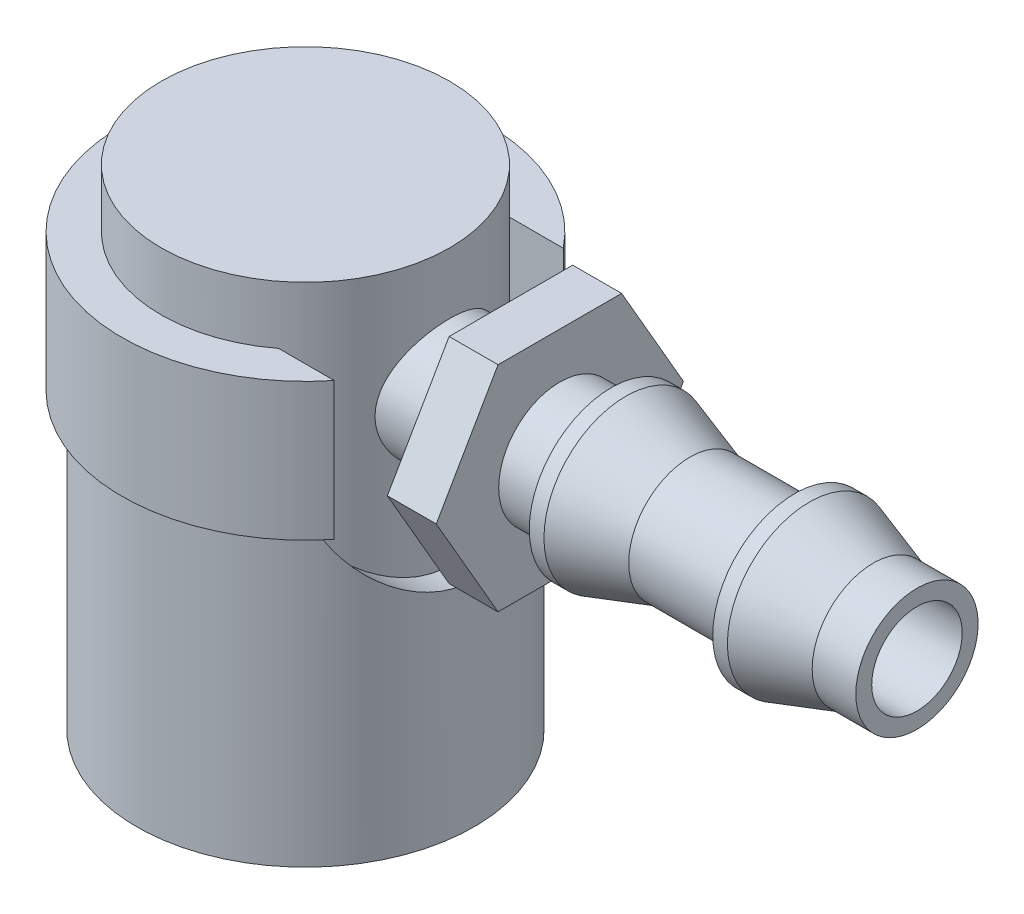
from build123d import *

# Parameters (mm, degrees)
BOSS_EXTRUDE1_DEPTH = 2.54
CUT_EXTRUDE1_REACH  = 44.99
SKETCH5_R           = 2.3495
SKETCH7_R           = 8.763
SKETCH7_R_2         = 7.493
BOSS_EXTRUDE2_DEPTH = 15.24
SKETCH9_R           = 6.35
CUT_EXTRUDE3_DEPTH  = 37.563209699
BOSS_EXTRUDE3_DEPTH = 7.14375
SKETCH10_W          = 1.4859
SKETCH10_H          = 4.445


with BuildPart() as part:
    # Sketch2 → Revolve1 (revolve)
    with BuildSketch(Plane.XY, mode=Mode.PRIVATE) as revolve1_sk:
        Polygon((0, 15.875), (7.493, 15.875), (7.493, -9.525), (4.7625, -9.525), (4.7625, -1.397), (5.0546, -1.228355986), (5.0546, 3.175), (3.5687, 3.175), (3.5687, 13.1445), (0, 13.1445), align=None)
    revolve(revolve1_sk.sketch.rotate(Axis((0, 0, 0), (0, 1, 0)), 90), axis=Axis((0, 0, 0), (0, 1, 0)))

    # Sketch3 → Revolve2 (revolve)
    with BuildSketch(Plane.XY, mode=Mode.PRIVATE) as revolve2_sk:
        Polygon((5.08, 11.8745), (5.08, 12.7), (15.875, 12.7), (15.875, 13.7795), (16.637, 13.7795), (19.959359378, 12.7), (25.4, 12.7), (25.4, 13.7795), (26.162, 13.7795), (29.484359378, 12.7), (31.75, 12.7), (31.75, 11.8745), align=None)
    revolve(revolve2_sk.sketch.rotate(Axis((-48.315471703, 9.525, 0), (1, 0, 0)), 90), axis=Axis((-48.315471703, 9.525, 0), (1, 0, 0)))

    # Sketch4 → Boss-Extrude1 (add)
    with BuildSketch(Plane(origin=(13.208, 0, 0), x_dir=(0, 0, -1), z_dir=(1, 0, 0))):
        Polygon((6.415804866, 9.525), (3.207902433, 15.08125), (-3.207902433, 15.08125), (-6.415804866, 9.525), (-3.207902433, 3.96875), (3.207902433, 3.96875), align=None)
    extrude(amount=-BOSS_EXTRUDE1_DEPTH)

    # Sketch5 → Cut-Extrude1 (cut, up to next)
    with BuildSketch(Plane(origin=(31.75, 0, 0), x_dir=(0, 0, -1), z_dir=(1, 0, 0)), mode=Mode.PRIVATE) as cut_extrude1_sk1:
        with Locations(Location((0, 9.525, 0), (0, 0, 180))):
            Circle(SKETCH5_R)
    cut_extrude1_tool1 = extrude(cut_extrude1_sk1.sketch, amount=-CUT_EXTRUDE1_REACH, mode=Mode.PRIVATE) & part.part
    add(cut_extrude1_tool1.solids().sort_by_distance((31.75, 9.525, 0))[0], mode=Mode.SUBTRACT)
    add(cut_extrude1_tool1.solids().sort_by_distance((31.75, 9.525, 0))[1], mode=Mode.SUBTRACT)



with BuildPart() as body_2:
    # Sketch7 → Boss-Extrude2 (new body)
    with BuildSketch(Plane.XZ.offset(9.525)):
        with Locations(Location((0, 0, 0), (0, 0, 270))):
            Circle(SKETCH7_R)
        with Locations(Location((0, 0, 0), (0, 0, 270))):
            Circle(SKETCH7_R_2, mode=Mode.SUBTRACT)
    extrude(amount=-BOSS_EXTRUDE2_DEPTH)

    # Sketch9 → Cut-Extrude3 (cut, through all)
    with BuildSketch(Plane(origin=(0, 0, 0), x_dir=(0, 0, -1), z_dir=(1, 0, 0))):
        with Locations((0, 7.9375)):
            Circle(SKETCH9_R)
    extrude(amount=CUT_EXTRUDE3_DEPTH, mode=Mode.SUBTRACT)


with BuildPart() as part_1:
    add(part.part)

    add(body_2.part)  # Boss-Extrude3 merges body 2
    # Sketch8 → Boss-Extrude3 (add)
    with BuildSketch(Plane(origin=(0, 5.715, 0), x_dir=(1, 0, 0), z_dir=(0, 1, 0))):
        with BuildLine():
            Line((4.556539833, 5.948360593), (7.439262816, 5.948360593))
            ThreePointArc((7.439262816, 5.948360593), (-9.525, 0), (7.439262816, -5.948360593))
            Line((7.439262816, -5.948360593), (4.556539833, -5.948360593))
            ThreePointArc((4.556539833, -5.948360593), (-7.493, 0), (4.556539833, 5.948360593))
        make_face()
    extrude(amount=BOSS_EXTRUDE3_DEPTH)


with BuildPart() as body_2_2:
    # Sketch10 → SC200S-V (revolve)
    with BuildSketch(Plane.XY, mode=Mode.PRIVATE) as sc200s_v_sk:
        with Locations((4.31165, 0.9525)):
            Rectangle(SKETCH10_W, SKETCH10_H)
    revolve(sc200s_v_sk.sketch.rotate(Axis((0, 4.234631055, 0), (0, -1, 0)), 90), axis=Axis((0, 4.234631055, 0), (0, -1, 0)))


solid = Compound([part_1.part, body_2_2.part])
